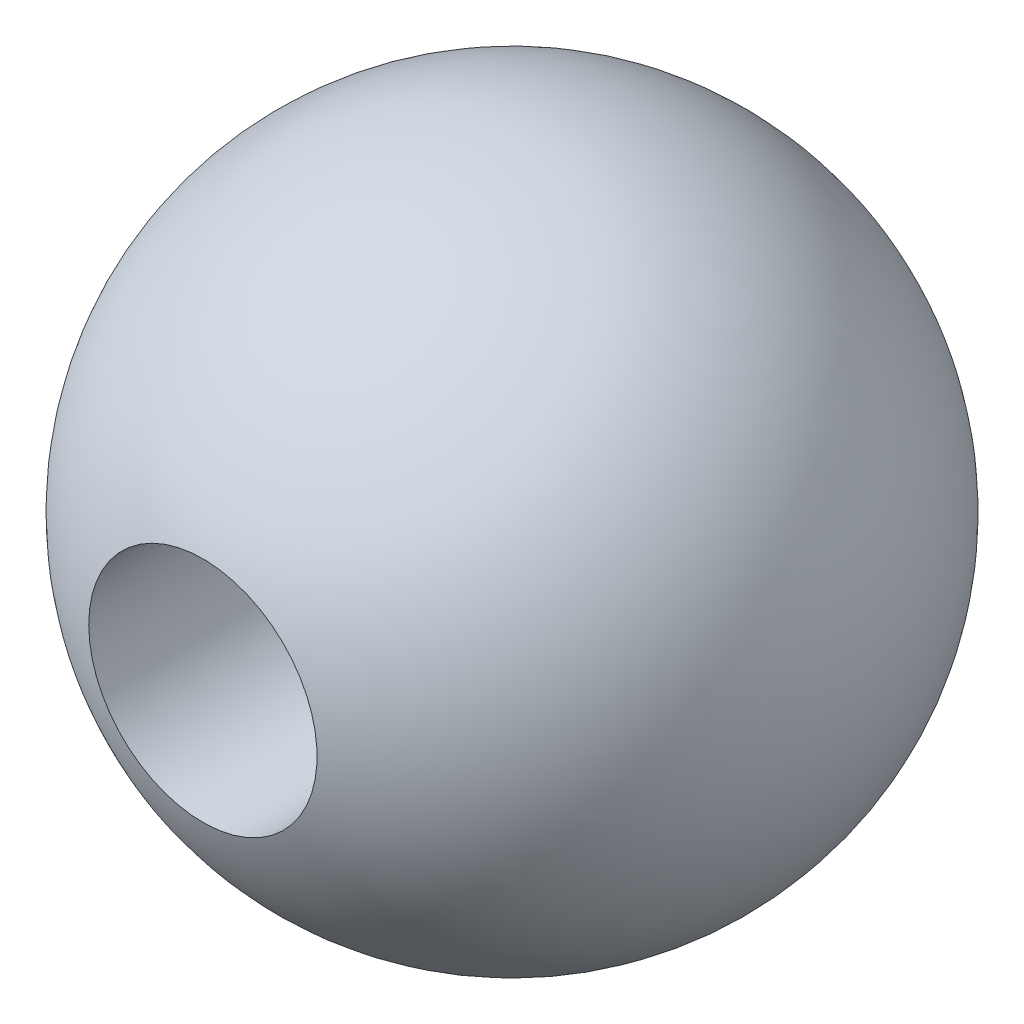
ISO-10303-21;
HEADER;
FILE_DESCRIPTION(('STEP AP214'),'2;1');
FILE_NAME('part.step','',(''),(''),'','','');
FILE_SCHEMA(('AUTOMOTIVE_DESIGN { 1 0 10303 214 1 1 1 1 }'));
ENDSEC;
DATA;
#1=APPLICATION_CONTEXT('core data for automotive mechanical design processes');
#2=APPLICATION_PROTOCOL_DEFINITION('international standard','automotive_design',2000,#1);
#3=PRODUCT_CONTEXT('',#1,'mechanical');
#4=PRODUCT('Part','Part','',(#3));
#5=PRODUCT_RELATED_PRODUCT_CATEGORY('part','',(#4));
#6=PRODUCT_DEFINITION_FORMATION('','',#4);
#7=PRODUCT_DEFINITION_CONTEXT('part definition',#1,'design');
#8=PRODUCT_DEFINITION('design','',#6,#7);
#9=PRODUCT_DEFINITION_SHAPE('','',#8);
#10=(LENGTH_UNIT() NAMED_UNIT(*) SI_UNIT(.MILLI.,.METRE.));
#11=(NAMED_UNIT(*) PLANE_ANGLE_UNIT() SI_UNIT($,.RADIAN.));
#12=(NAMED_UNIT(*) SI_UNIT($,.STERADIAN.) SOLID_ANGLE_UNIT());
#13=UNCERTAINTY_MEASURE_WITH_UNIT(LENGTH_MEASURE(1.E-05),#10,'distance_accuracy_value','');
#14=(GEOMETRIC_REPRESENTATION_CONTEXT(3) GLOBAL_UNCERTAINTY_ASSIGNED_CONTEXT((#13)) GLOBAL_UNIT_ASSIGNED_CONTEXT((#10,
#11,#12)) REPRESENTATION_CONTEXT('',''));
#15=CARTESIAN_POINT('',(0.,0.,0.));
#16=DIRECTION('',(0.,0.,1.));
#17=DIRECTION('',(1.,0.,0.));
#18=AXIS2_PLACEMENT_3D('',#15,#16,#17);
#19=CARTESIAN_POINT('',(0.,0.,0.));
#20=DIRECTION('',(0.,1.,0.));
#21=DIRECTION('',(1.,0.,0.));
#22=AXIS2_PLACEMENT_3D('',#19,#20,#21);
#23=SPHERICAL_SURFACE('',#22,2.165);
#24=CARTESIAN_POINT('',(0.,0.,0.));
#25=DIRECTION('',(0.,0.,-1.));
#26=DIRECTION('',(-1.,0.,0.));
#27=AXIS2_PLACEMENT_3D('',#24,#25,#26);
#28=SPHERICAL_SURFACE('',#27,2.165);
#29=CARTESIAN_POINT('',(0.,0.,2.03094189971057));
#30=DIRECTION('',(0.,0.,-1.));
#31=DIRECTION('',(-1.,0.,0.));
#32=AXIS2_PLACEMENT_3D('',#29,#30,#31);
#33=CIRCLE('',#32,0.75);
#34=CARTESIAN_POINT('',(-0.75,0.,2.03094189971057));
#35=VERTEX_POINT('',#34);
#36=EDGE_CURVE('E47',#35,#35,#33,.T.);
#37=ORIENTED_EDGE('',*,*,#36,.T.);
#38=EDGE_LOOP('',(#37));
#39=FACE_BOUND('',#38,.T.);
#40=CARTESIAN_POINT('',(0.,0.,-2.03094189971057));
#41=DIRECTION('',(0.,0.,1.));
#42=DIRECTION('',(1.,0.,0.));
#43=AXIS2_PLACEMENT_3D('',#40,#41,#42);
#44=CIRCLE('',#43,0.75);
#45=CARTESIAN_POINT('',(0.75,0.,-2.03094189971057));
#46=VERTEX_POINT('',#45);
#47=EDGE_CURVE('E10',#46,#46,#44,.T.);
#48=ORIENTED_EDGE('',*,*,#47,.T.);
#49=EDGE_LOOP('',(#48));
#50=FACE_BOUND('',#49,.T.);
#51=ADVANCED_FACE('F41',(#39,#50),#28,.T.);
#52=CARTESIAN_POINT('',(0.,0.,5.));
#53=DIRECTION('',(0.,0.,-1.));
#54=DIRECTION('',(-1.,0.,0.));
#55=AXIS2_PLACEMENT_3D('',#52,#53,#54);
#56=CYLINDRICAL_SURFACE('',#55,0.75);
#57=ORIENTED_EDGE('',*,*,#47,.F.);
#58=EDGE_LOOP('',(#57));
#59=FACE_BOUND('',#58,.T.);
#60=ORIENTED_EDGE('',*,*,#36,.F.);
#61=EDGE_LOOP('',(#60));
#62=FACE_BOUND('',#61,.T.);
#63=ADVANCED_FACE('F54',(#59,#62),#56,.F.);
#64=CLOSED_SHELL('',(#51,#63));
#65=MANIFOLD_SOLID_BREP('B2',#64);
#66=ADVANCED_BREP_SHAPE_REPRESENTATION('',(#18,#65),#14);
#67=SHAPE_DEFINITION_REPRESENTATION(#9,#66);
ENDSEC;
END-ISO-10303-21;
